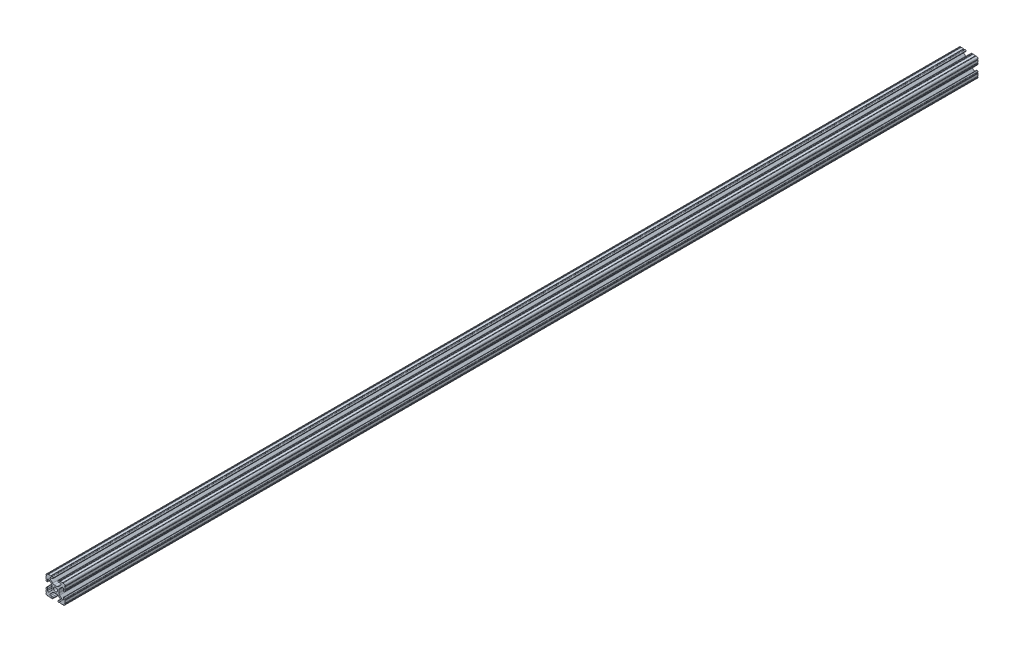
from build123d import *

# Parameters (mm, degrees)
SKETCH1_R               = 2.6035
BOSS_EXTRUDE1_DEPTH     = 762
CUT_EXTRUDE1_DEPTH      = 763.211637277
CUT_EXTRUDE1_DEPTH_BACK = 763.211637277
SKETCH2_W               = 304.8
SKETCH2_H               = 75.707633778


with BuildPart() as part:
    # Sketch1 → Boss-Extrude1 (new, symmetric)
    with BuildSketch(Plane.XY):
        with BuildLine():
            Line((-7.179650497, -8.645192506), (-3.952270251, -5.423690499))
            ThreePointArc((-3.952270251, -5.423690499), (-2.922936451, -4.736929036), (-1.709253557, -4.4958))
            Line((-1.709253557, -4.4958), (1.709253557, -4.4958))
            ThreePointArc((1.709253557, -4.4958), (2.922936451, -4.736929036), (3.952270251, -5.423690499))
            Line((3.952270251, -5.423690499), (7.179650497, -8.645192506))
            ThreePointArc((7.179650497, -8.645192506), (7.41473083, -9.822813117), (6.416408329, -10.4902))
            Line((6.416408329, -10.4902), (4.287512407, -10.4902))
            ThreePointArc((4.287512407, -10.4902), (3.54574862, -10.79744862), (3.2385, -11.539212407))
            Line((3.2385, -11.539212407), (3.2385, -11.650987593))
            ThreePointArc((3.2385, -11.650987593), (3.54574862, -12.39275138), (4.287512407, -12.7))
            Line((4.287512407, -12.7), (5.317126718, -12.7))
            ThreePointArc((5.317126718, -12.7), (5.825126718, -12.192), (6.333126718, -12.7))
            Line((6.333126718, -12.7), (9.550443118, -12.7))
            ThreePointArc((9.550443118, -12.7), (10.058366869, -12.192000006), (10.566443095, -12.699847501))
            ThreePointArc((10.566443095, -12.699847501), (12.082537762, -12.08250727), (12.699846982, -10.566399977))
            ThreePointArc((12.699846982, -10.566399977), (12.192000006, -10.058323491), (12.7, -9.5504))
            Line((12.7, -9.5504), (12.7, -6.3330836))
            ThreePointArc((12.7, -6.3330836), (12.192, -5.8250836), (12.7, -5.3170836))
            Line((12.7, -5.3170836), (12.7, -4.287469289))
            ThreePointArc((12.7, -4.287469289), (12.39275138, -3.545705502), (11.650987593, -3.238456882))
            Line((11.650987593, -3.238456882), (11.539212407, -3.238456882))
            ThreePointArc((11.539212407, -3.238456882), (10.79744862, -3.545705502), (10.4902, -4.287469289))
            Line((10.4902, -4.287469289), (10.4902, -6.402089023))
            ThreePointArc((10.4902, -6.402089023), (9.856505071, -7.351067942), (8.737131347, -7.129408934))
            Line((8.737131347, -7.129408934), (5.441005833, -3.840816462))
            ThreePointArc((5.441005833, -3.840816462), (4.750877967, -2.809883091), (4.5085, -1.593185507))
            Line((4.5085, -1.593185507), (4.5085, 1.593185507))
            ThreePointArc((4.5085, 1.593185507), (4.750877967, 2.809883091), (5.441005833, 3.840816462))
            Line((5.441005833, 3.840816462), (8.737131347, 7.129408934))
            ThreePointArc((8.737131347, 7.129408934), (9.856505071, 7.351067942), (10.4902, 6.402089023))
            Line((10.4902, 6.402089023), (10.4902, 4.287469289))
            ThreePointArc((10.4902, 4.287469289), (10.79744862, 3.545705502), (11.539212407, 3.238456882))
            Line((11.539212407, 3.238456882), (11.650987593, 3.238456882))
            ThreePointArc((11.650987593, 3.238456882), (12.39275138, 3.545705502), (12.7, 4.287469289))
            Line((12.7, 4.287469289), (12.7, 5.3170836))
            ThreePointArc((12.7, 5.3170836), (12.192, 5.8250836), (12.7, 6.3330836))
            Line((12.7, 6.3330836), (12.7, 9.5504))
            ThreePointArc((12.7, 9.5504), (12.192000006, 10.058323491), (12.699846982, 10.566399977))
            ThreePointArc((12.699846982, 10.566399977), (12.082537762, 12.08250727), (10.566443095, 12.699847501))
            ThreePointArc((10.566443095, 12.699847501), (10.058366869, 12.192000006), (9.550443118, 12.7))
            Line((9.550443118, 12.7), (6.333126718, 12.7))
            ThreePointArc((6.333126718, 12.7), (5.825126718, 12.192), (5.317126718, 12.7))
            Line((5.317126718, 12.7), (4.287512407, 12.7))
            ThreePointArc((4.287512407, 12.7), (3.54574862, 12.39275138), (3.2385, 11.650987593))
            Line((3.2385, 11.650987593), (3.2385, 11.539212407))
            ThreePointArc((3.2385, 11.539212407), (3.54574862, 10.79744862), (4.287512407, 10.4902))
            Line((4.287512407, 10.4902), (6.476788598, 10.4902))
            ThreePointArc((6.476788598, 10.4902), (7.432222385, 9.85140422), (7.207036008, 8.724370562))
            Line((7.207036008, 8.724370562), (3.898272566, 5.423169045))
            ThreePointArc((3.898272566, 5.423169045), (2.869120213, 4.736787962), (1.655778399, 4.4958))
            Line((1.655778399, 4.4958), (-1.655778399, 4.4958))
            ThreePointArc((-1.655778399, 4.4958), (-2.869120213, 4.736787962), (-3.898272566, 5.423169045))
            Line((-3.898272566, 5.423169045), (-7.207036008, 8.724370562))
            ThreePointArc((-7.207036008, 8.724370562), (-7.432222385, 9.85140422), (-6.476788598, 10.4902))
            Line((-6.476788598, 10.4902), (-4.287512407, 10.4902))
            ThreePointArc((-4.287512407, 10.4902), (-3.54574862, 10.79744862), (-3.2385, 11.539212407))
            Line((-3.2385, 11.539212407), (-3.2385, 11.650987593))
            ThreePointArc((-3.2385, 11.650987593), (-3.54574862, 12.39275138), (-4.287512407, 12.7))
            Line((-4.287512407, 12.7), (-5.317126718, 12.7))
            ThreePointArc((-5.317126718, 12.7), (-5.825126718, 12.192), (-6.333126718, 12.7))
            Line((-6.333126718, 12.7), (-9.550443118, 12.7))
            ThreePointArc((-9.550443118, 12.7), (-10.058366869, 12.192000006), (-10.566443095, 12.699847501))
            ThreePointArc((-10.566443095, 12.699847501), (-12.082537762, 12.08250727), (-12.699846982, 10.566399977))
            ThreePointArc((-12.699846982, 10.566399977), (-12.192000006, 10.058323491), (-12.7, 9.5504))
            Line((-12.7, 9.5504), (-12.7, 6.3330836))
            ThreePointArc((-12.7, 6.3330836), (-12.192, 5.8250836), (-12.7, 5.3170836))
            Line((-12.7, 5.3170836), (-12.7, 4.287469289))
            ThreePointArc((-12.7, 4.287469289), (-12.39275138, 3.545705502), (-11.650987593, 3.238456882))
            Line((-11.650987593, 3.238456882), (-11.539212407, 3.238456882))
            ThreePointArc((-11.539212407, 3.238456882), (-10.79744862, 3.545705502), (-10.4902, 4.287469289))
            Line((-10.4902, 4.287469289), (-10.4902, 6.402089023))
            ThreePointArc((-10.4902, 6.402089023), (-9.856505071, 7.351067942), (-8.737131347, 7.129408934))
            Line((-8.737131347, 7.129408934), (-5.441005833, 3.840816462))
            ThreePointArc((-5.441005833, 3.840816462), (-4.750877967, 2.809883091), (-4.5085, 1.593185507))
            Line((-4.5085, 1.593185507), (-4.5085, -1.593185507))
            ThreePointArc((-4.5085, -1.593185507), (-4.750877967, -2.809883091), (-5.441005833, -3.840816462))
            Line((-5.441005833, -3.840816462), (-8.737131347, -7.129408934))
            ThreePointArc((-8.737131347, -7.129408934), (-9.856505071, -7.351067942), (-10.4902, -6.402089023))
            Line((-10.4902, -6.402089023), (-10.4902, -4.287469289))
            ThreePointArc((-10.4902, -4.287469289), (-10.79744862, -3.545705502), (-11.539212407, -3.238456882))
            Line((-11.539212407, -3.238456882), (-11.650987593, -3.238456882))
            ThreePointArc((-11.650987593, -3.238456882), (-12.39275138, -3.545705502), (-12.7, -4.287469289))
            Line((-12.7, -4.287469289), (-12.7, -5.3170836))
            ThreePointArc((-12.7, -5.3170836), (-12.192, -5.8250836), (-12.7, -6.3330836))
            Line((-12.7, -6.3330836), (-12.7, -9.5504))
            ThreePointArc((-12.7, -9.5504), (-12.192000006, -10.058323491), (-12.699846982, -10.566399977))
            ThreePointArc((-12.699846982, -10.566399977), (-12.082537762, -12.08250727), (-10.566443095, -12.699847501))
            ThreePointArc((-10.566443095, -12.699847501), (-10.058366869, -12.192000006), (-9.550443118, -12.7))
            Line((-9.550443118, -12.7), (-6.333126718, -12.7))
            ThreePointArc((-6.333126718, -12.7), (-5.825126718, -12.192), (-5.317126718, -12.7))
            Line((-5.317126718, -12.7), (-4.287512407, -12.7))
            ThreePointArc((-4.287512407, -12.7), (-3.54574862, -12.39275138), (-3.2385, -11.650987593))
            Line((-3.2385, -11.650987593), (-3.2385, -11.539212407))
            ThreePointArc((-3.2385, -11.539212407), (-3.54574862, -10.79744862), (-4.287512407, -10.4902))
            Line((-4.287512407, -10.4902), (-6.416408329, -10.4902))
            ThreePointArc((-6.416408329, -10.4902), (-7.41473083, -9.822813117), (-7.179650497, -8.645192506))
        make_face()
        Circle(SKETCH1_R, mode=Mode.SUBTRACT)
    extrude(amount=BOSS_EXTRUDE1_DEPTH, both=True)

    # Sketch2 → Cut-Extrude1 (cut, two sides: drawn at the far end of the back side and taken through both)
    with BuildSketch(Plane(origin=(0, 0, 0), x_dir=(0, 0, -1), z_dir=(1, 0, 0)).offset(-CUT_EXTRUDE1_DEPTH_BACK)):
        with Locations((609.6, 2.608006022)):
            Rectangle(SKETCH2_W, SKETCH2_H)
    extrude(amount=CUT_EXTRUDE1_DEPTH + CUT_EXTRUDE1_DEPTH_BACK, mode=Mode.SUBTRACT)


solid = part.part
